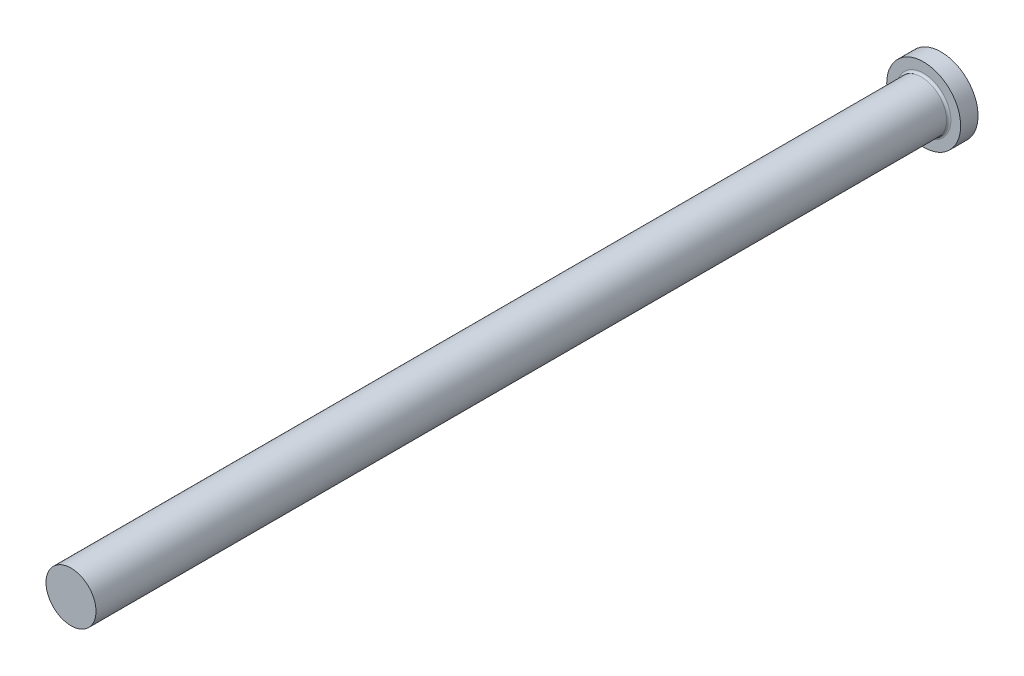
ISO-10303-21;
HEADER;
FILE_DESCRIPTION(('STEP AP214'),'2;1');
FILE_NAME('part.step','',(''),(''),'','','');
FILE_SCHEMA(('AUTOMOTIVE_DESIGN { 1 0 10303 214 1 1 1 1 }'));
ENDSEC;
DATA;
#1=APPLICATION_CONTEXT('core data for automotive mechanical design processes');
#2=APPLICATION_PROTOCOL_DEFINITION('international standard','automotive_design',2000,#1);
#3=PRODUCT_CONTEXT('',#1,'mechanical');
#4=PRODUCT('Part','Part','',(#3));
#5=PRODUCT_RELATED_PRODUCT_CATEGORY('part','',(#4));
#6=PRODUCT_DEFINITION_FORMATION('','',#4);
#7=PRODUCT_DEFINITION_CONTEXT('part definition',#1,'design');
#8=PRODUCT_DEFINITION('design','',#6,#7);
#9=PRODUCT_DEFINITION_SHAPE('','',#8);
#10=(LENGTH_UNIT() NAMED_UNIT(*) SI_UNIT(.MILLI.,.METRE.));
#11=(NAMED_UNIT(*) PLANE_ANGLE_UNIT() SI_UNIT($,.RADIAN.));
#12=(NAMED_UNIT(*) SI_UNIT($,.STERADIAN.) SOLID_ANGLE_UNIT());
#13=UNCERTAINTY_MEASURE_WITH_UNIT(LENGTH_MEASURE(1.E-05),#10,'distance_accuracy_value','');
#14=(GEOMETRIC_REPRESENTATION_CONTEXT(3) GLOBAL_UNCERTAINTY_ASSIGNED_CONTEXT((#13)) GLOBAL_UNIT_ASSIGNED_CONTEXT((#10,
#11,#12)) REPRESENTATION_CONTEXT('',''));
#15=CARTESIAN_POINT('',(0.,0.,0.));
#16=DIRECTION('',(0.,0.,1.));
#17=DIRECTION('',(1.,0.,0.));
#18=AXIS2_PLACEMENT_3D('',#15,#16,#17);
#19=CARTESIAN_POINT('',(8.5,0.,4.));
#20=DIRECTION('',(0.,0.,-1.));
#21=DIRECTION('',(-1.,0.,0.));
#22=AXIS2_PLACEMENT_3D('',#19,#20,#21);
#23=PLANE('',#22);
#24=CARTESIAN_POINT('',(0.,0.,4.));
#25=DIRECTION('',(0.,0.,-1.));
#26=DIRECTION('',(-1.,0.,0.));
#27=AXIS2_PLACEMENT_3D('',#24,#25,#26);
#28=CIRCLE('',#27,6.25000000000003);
#29=CARTESIAN_POINT('',(-6.25000000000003,0.,4.));
#30=VERTEX_POINT('',#29);
#31=EDGE_CURVE('E40',#30,#30,#28,.T.);
#32=ORIENTED_EDGE('',*,*,#31,.T.);
#33=EDGE_LOOP('',(#32));
#34=FACE_BOUND('',#33,.T.);
#35=CARTESIAN_POINT('',(0.,0.,4.));
#36=DIRECTION('',(0.,0.,-1.));
#37=DIRECTION('',(-1.,0.,0.));
#38=AXIS2_PLACEMENT_3D('',#35,#36,#37);
#39=CIRCLE('',#38,8.5);
#40=CARTESIAN_POINT('',(-8.5,0.,4.));
#41=VERTEX_POINT('',#40);
#42=EDGE_CURVE('E44',#41,#41,#39,.T.);
#43=ORIENTED_EDGE('',*,*,#42,.F.);
#44=EDGE_LOOP('',(#43));
#45=FACE_BOUND('',#44,.T.);
#46=ADVANCED_FACE('F33',(#34,#45),#23,.F.);
#47=CARTESIAN_POINT('',(0.,0.,-9.03322817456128));
#48=DIRECTION('',(0.,0.,-1.));
#49=DIRECTION('',(-1.,0.,0.));
#50=AXIS2_PLACEMENT_3D('',#47,#48,#49);
#51=CYLINDRICAL_SURFACE('',#50,8.5);
#52=CARTESIAN_POINT('',(0.,0.,0.));
#53=DIRECTION('',(0.,0.,-1.));
#54=DIRECTION('',(-1.,0.,0.));
#55=AXIS2_PLACEMENT_3D('',#52,#53,#54);
#56=CIRCLE('',#55,8.5);
#57=CARTESIAN_POINT('',(-8.5,0.,0.));
#58=VERTEX_POINT('',#57);
#59=EDGE_CURVE('E48',#58,#58,#56,.T.);
#60=ORIENTED_EDGE('',*,*,#59,.F.);
#61=EDGE_LOOP('',(#60));
#62=FACE_BOUND('',#61,.T.);
#63=ORIENTED_EDGE('',*,*,#42,.T.);
#64=EDGE_LOOP('',(#63));
#65=FACE_BOUND('',#64,.T.);
#66=ADVANCED_FACE('F68',(#62,#65),#51,.T.);
#67=CARTESIAN_POINT('',(0.,0.,0.));
#68=DIRECTION('',(0.,0.,1.));
#69=DIRECTION('',(1.,0.,0.));
#70=AXIS2_PLACEMENT_3D('',#67,#68,#69);
#71=PLANE('',#70);
#72=ORIENTED_EDGE('',*,*,#59,.T.);
#73=EDGE_LOOP('',(#72));
#74=FACE_BOUND('',#73,.T.);
#75=ADVANCED_FACE('F61',(#74),#71,.F.);
#76=CARTESIAN_POINT('',(0.,0.,200.));
#77=DIRECTION('',(0.,0.,-1.));
#78=DIRECTION('',(-1.,0.,0.));
#79=AXIS2_PLACEMENT_3D('',#76,#77,#78);
#80=PLANE('',#79);
#81=CARTESIAN_POINT('',(0.,0.,200.));
#82=DIRECTION('',(0.,0.,-1.));
#83=DIRECTION('',(-1.,0.,0.));
#84=AXIS2_PLACEMENT_3D('',#81,#82,#83);
#85=CIRCLE('',#84,5.75000000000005);
#86=CARTESIAN_POINT('',(-5.75000000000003,0.,200.));
#87=VERTEX_POINT('',#86);
#88=EDGE_CURVE('E53',#87,#87,#85,.T.);
#89=ORIENTED_EDGE('',*,*,#88,.F.);
#90=EDGE_LOOP('',(#89));
#91=FACE_BOUND('',#90,.T.);
#92=ADVANCED_FACE('F59',(#91),#80,.F.);
#93=CARTESIAN_POINT('',(0.,0.,-9.03322817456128));
#94=DIRECTION('',(0.,0.,-1.));
#95=DIRECTION('',(-1.,0.,0.));
#96=AXIS2_PLACEMENT_3D('',#93,#94,#95);
#97=CYLINDRICAL_SURFACE('',#96,5.75000000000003);
#98=CARTESIAN_POINT('',(0.,0.,4.5));
#99=DIRECTION('',(0.,0.,-1.));
#100=DIRECTION('',(-1.,0.,0.));
#101=AXIS2_PLACEMENT_3D('',#98,#99,#100);
#102=CIRCLE('',#101,5.75000000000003);
#103=CARTESIAN_POINT('',(-5.75000000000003,0.,4.5));
#104=VERTEX_POINT('',#103);
#105=EDGE_CURVE('E10',#104,#104,#102,.F.);
#106=ORIENTED_EDGE('',*,*,#105,.T.);
#107=EDGE_LOOP('',(#106));
#108=FACE_BOUND('',#107,.T.);
#109=ORIENTED_EDGE('',*,*,#88,.T.);
#110=EDGE_LOOP('',(#109));
#111=FACE_BOUND('',#110,.T.);
#112=ADVANCED_FACE('F57',(#108,#111),#97,.T.);
#113=CARTESIAN_POINT('',(0.,0.,4.5));
#114=DIRECTION('',(0.,0.,-1.));
#115=DIRECTION('',(-1.,0.,0.));
#116=AXIS2_PLACEMENT_3D('',#113,#114,#115);
#117=TOROIDAL_SURFACE('',#116,6.25000000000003,0.5);
#118=ORIENTED_EDGE('',*,*,#105,.F.);
#119=EDGE_LOOP('',(#118));
#120=FACE_BOUND('',#119,.T.);
#121=ORIENTED_EDGE('',*,*,#31,.F.);
#122=EDGE_LOOP('',(#121));
#123=FACE_BOUND('',#122,.T.);
#124=ADVANCED_FACE('F35',(#120,#123),#117,.F.);
#125=CLOSED_SHELL('',(#46,#66,#75,#92,#112,#124));
#126=MANIFOLD_SOLID_BREP('B2',#125);
#127=ADVANCED_BREP_SHAPE_REPRESENTATION('',(#18,#126),#14);
#128=SHAPE_DEFINITION_REPRESENTATION(#9,#127);
ENDSEC;
END-ISO-10303-21;
